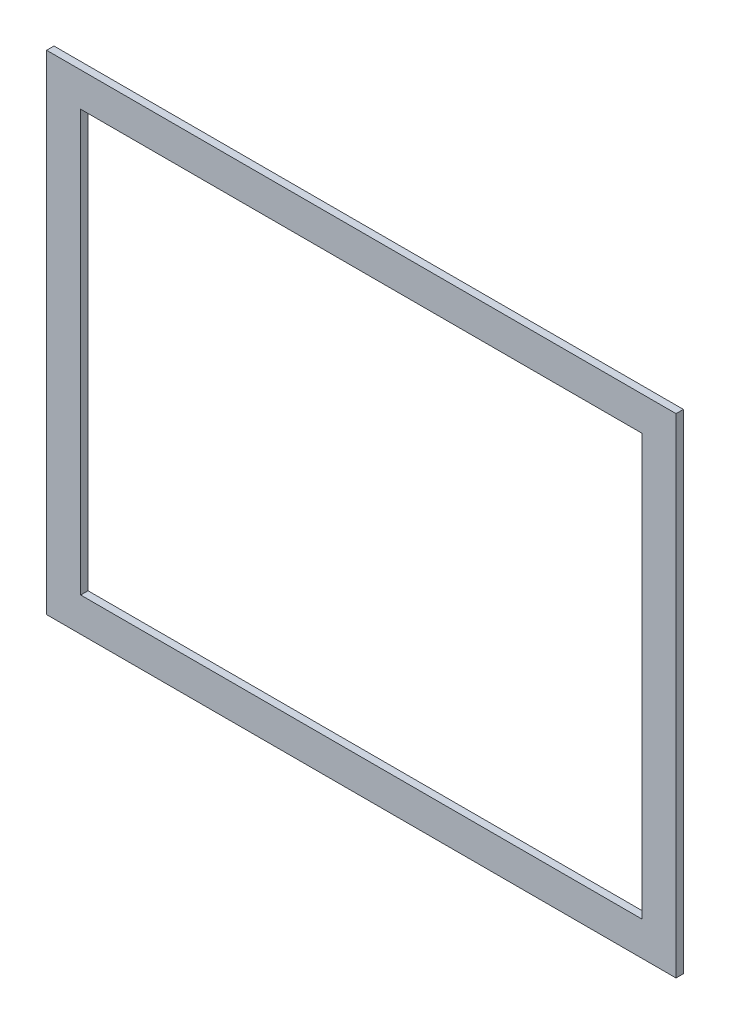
ISO-10303-21;
HEADER;
FILE_DESCRIPTION(('STEP AP214'),'2;1');
FILE_NAME('part.step','',(''),(''),'','','');
FILE_SCHEMA(('AUTOMOTIVE_DESIGN { 1 0 10303 214 1 1 1 1 }'));
ENDSEC;
DATA;
#1=APPLICATION_CONTEXT('core data for automotive mechanical design processes');
#2=APPLICATION_PROTOCOL_DEFINITION('international standard','automotive_design',2000,#1);
#3=PRODUCT_CONTEXT('',#1,'mechanical');
#4=PRODUCT('Part','Part','',(#3));
#5=PRODUCT_RELATED_PRODUCT_CATEGORY('part','',(#4));
#6=PRODUCT_DEFINITION_FORMATION('','',#4);
#7=PRODUCT_DEFINITION_CONTEXT('part definition',#1,'design');
#8=PRODUCT_DEFINITION('design','',#6,#7);
#9=PRODUCT_DEFINITION_SHAPE('','',#8);
#10=(LENGTH_UNIT() NAMED_UNIT(*) SI_UNIT(.MILLI.,.METRE.));
#11=(NAMED_UNIT(*) PLANE_ANGLE_UNIT() SI_UNIT($,.RADIAN.));
#12=(NAMED_UNIT(*) SI_UNIT($,.STERADIAN.) SOLID_ANGLE_UNIT());
#13=UNCERTAINTY_MEASURE_WITH_UNIT(LENGTH_MEASURE(1.E-05),#10,'distance_accuracy_value','');
#14=(GEOMETRIC_REPRESENTATION_CONTEXT(3) GLOBAL_UNCERTAINTY_ASSIGNED_CONTEXT((#13)) GLOBAL_UNIT_ASSIGNED_CONTEXT((#10,
#11,#12)) REPRESENTATION_CONTEXT('',''));
#15=CARTESIAN_POINT('',(0.,0.,0.));
#16=DIRECTION('',(0.,0.,1.));
#17=DIRECTION('',(1.,0.,0.));
#18=AXIS2_PLACEMENT_3D('',#15,#16,#17);
#19=CARTESIAN_POINT('',(0.,0.,0.65));
#20=DIRECTION('',(0.,0.,-1.));
#21=DIRECTION('',(-1.,0.,0.));
#22=AXIS2_PLACEMENT_3D('',#19,#20,#21);
#23=PLANE('',#22);
#24=DIRECTION('',(-1.,0.,0.));
#25=VECTOR('',#24,1.);
#26=CARTESIAN_POINT('',(-30.1999999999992,58.3899999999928,0.65));
#27=LINE('',#26,#25);
#28=CARTESIAN_POINT('',(25.3000000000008,58.3899999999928,0.65));
#29=VERTEX_POINT('',#28);
#30=CARTESIAN_POINT('',(-30.1999999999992,58.3899999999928,0.65));
#31=VERTEX_POINT('',#30);
#32=EDGE_CURVE('E140',#29,#31,#27,.T.);
#33=ORIENTED_EDGE('',*,*,#32,.T.);
#34=DIRECTION('',(0.,-1.,0.));
#35=VECTOR('',#34,1.);
#36=CARTESIAN_POINT('',(-30.1999999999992,58.3899999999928,0.65));
#37=LINE('',#36,#35);
#38=CARTESIAN_POINT('',(-30.1999999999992,15.2899999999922,0.65));
#39=VERTEX_POINT('',#38);
#40=EDGE_CURVE('E143',#31,#39,#37,.T.);
#41=ORIENTED_EDGE('',*,*,#40,.T.);
#42=DIRECTION('',(1.,0.,0.));
#43=VECTOR('',#42,1.);
#44=CARTESIAN_POINT('',(-30.1999999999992,15.2899999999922,0.65));
#45=LINE('',#44,#43);
#46=CARTESIAN_POINT('',(25.3000000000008,15.2899999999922,0.65));
#47=VERTEX_POINT('',#46);
#48=EDGE_CURVE('E146',#39,#47,#45,.T.);
#49=ORIENTED_EDGE('',*,*,#48,.T.);
#50=DIRECTION('',(0.,1.,0.));
#51=VECTOR('',#50,1.);
#52=CARTESIAN_POINT('',(25.3000000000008,58.3899999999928,0.65));
#53=LINE('',#52,#51);
#54=EDGE_CURVE('E148',#47,#29,#53,.T.);
#55=ORIENTED_EDGE('',*,*,#54,.T.);
#56=EDGE_LOOP('',(#33,#41,#49,#55));
#57=FACE_BOUND('',#56,.T.);
#58=DIRECTION('',(0.,-1.,0.));
#59=VECTOR('',#58,1.);
#60=CARTESIAN_POINT('',(-27.1999999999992,55.3899999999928,0.65));
#61=LINE('',#60,#59);
#62=CARTESIAN_POINT('',(-27.1999999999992,55.3899999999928,0.65));
#63=VERTEX_POINT('',#62);
#64=CARTESIAN_POINT('',(-27.1999999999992,18.2899999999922,0.65));
#65=VERTEX_POINT('',#64);
#66=EDGE_CURVE('E104',#63,#65,#61,.T.);
#67=ORIENTED_EDGE('',*,*,#66,.F.);
#68=DIRECTION('',(-1.,0.,0.));
#69=VECTOR('',#68,1.);
#70=CARTESIAN_POINT('',(-27.1999999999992,55.3899999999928,0.65));
#71=LINE('',#70,#69);
#72=CARTESIAN_POINT('',(22.3000000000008,55.3899999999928,0.65));
#73=VERTEX_POINT('',#72);
#74=EDGE_CURVE('E126',#73,#63,#71,.T.);
#75=ORIENTED_EDGE('',*,*,#74,.F.);
#76=DIRECTION('',(0.,1.,0.));
#77=VECTOR('',#76,1.);
#78=CARTESIAN_POINT('',(22.3000000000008,55.3899999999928,0.65));
#79=LINE('',#78,#77);
#80=CARTESIAN_POINT('',(22.3000000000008,18.2899999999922,0.65));
#81=VERTEX_POINT('',#80);
#82=EDGE_CURVE('E124',#81,#73,#79,.T.);
#83=ORIENTED_EDGE('',*,*,#82,.F.);
#84=DIRECTION('',(1.,0.,0.));
#85=VECTOR('',#84,1.);
#86=CARTESIAN_POINT('',(-27.1999999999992,18.2899999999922,0.65));
#87=LINE('',#86,#85);
#88=EDGE_CURVE('E112',#65,#81,#87,.T.);
#89=ORIENTED_EDGE('',*,*,#88,.F.);
#90=EDGE_LOOP('',(#67,#75,#83,#89));
#91=FACE_BOUND('',#90,.T.);
#92=ADVANCED_FACE('F39',(#57,#91),#23,.F.);
#93=CARTESIAN_POINT('',(0.,0.,0.));
#94=DIRECTION('',(0.,0.,-1.));
#95=DIRECTION('',(-1.,0.,0.));
#96=AXIS2_PLACEMENT_3D('',#93,#94,#95);
#97=PLANE('',#96);
#98=DIRECTION('',(-1.,0.,0.));
#99=VECTOR('',#98,1.);
#100=CARTESIAN_POINT('',(-30.1999999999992,58.3899999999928,0.));
#101=LINE('',#100,#99);
#102=CARTESIAN_POINT('',(25.3000000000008,58.3899999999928,0.));
#103=VERTEX_POINT('',#102);
#104=CARTESIAN_POINT('',(-30.1999999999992,58.3899999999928,0.));
#105=VERTEX_POINT('',#104);
#106=EDGE_CURVE('E120',#103,#105,#101,.T.);
#107=ORIENTED_EDGE('',*,*,#106,.F.);
#108=DIRECTION('',(0.,1.,0.));
#109=VECTOR('',#108,1.);
#110=CARTESIAN_POINT('',(25.3000000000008,58.3899999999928,0.));
#111=LINE('',#110,#109);
#112=CARTESIAN_POINT('',(25.3000000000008,15.2899999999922,0.));
#113=VERTEX_POINT('',#112);
#114=EDGE_CURVE('E144',#113,#103,#111,.T.);
#115=ORIENTED_EDGE('',*,*,#114,.F.);
#116=DIRECTION('',(1.,0.,0.));
#117=VECTOR('',#116,1.);
#118=CARTESIAN_POINT('',(-30.1999999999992,15.2899999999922,0.));
#119=LINE('',#118,#117);
#120=CARTESIAN_POINT('',(-30.1999999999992,15.2899999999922,0.));
#121=VERTEX_POINT('',#120);
#122=EDGE_CURVE('E155',#121,#113,#119,.T.);
#123=ORIENTED_EDGE('',*,*,#122,.F.);
#124=DIRECTION('',(0.,-1.,0.));
#125=VECTOR('',#124,1.);
#126=CARTESIAN_POINT('',(-30.1999999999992,58.3899999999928,0.));
#127=LINE('',#126,#125);
#128=EDGE_CURVE('E153',#105,#121,#127,.T.);
#129=ORIENTED_EDGE('',*,*,#128,.F.);
#130=EDGE_LOOP('',(#107,#115,#123,#129));
#131=FACE_BOUND('',#130,.T.);
#132=DIRECTION('',(-1.,0.,0.));
#133=VECTOR('',#132,1.);
#134=CARTESIAN_POINT('',(-27.1999999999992,55.3899999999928,0.));
#135=LINE('',#134,#133);
#136=CARTESIAN_POINT('',(22.3000000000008,55.3899999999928,0.));
#137=VERTEX_POINT('',#136);
#138=CARTESIAN_POINT('',(-27.1999999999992,55.3899999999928,0.));
#139=VERTEX_POINT('',#138);
#140=EDGE_CURVE('E113',#137,#139,#135,.T.);
#141=ORIENTED_EDGE('',*,*,#140,.T.);
#142=DIRECTION('',(0.,-1.,0.));
#143=VECTOR('',#142,1.);
#144=CARTESIAN_POINT('',(-27.1999999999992,55.3899999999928,0.));
#145=LINE('',#144,#143);
#146=CARTESIAN_POINT('',(-27.1999999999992,18.2899999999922,0.));
#147=VERTEX_POINT('',#146);
#148=EDGE_CURVE('E62',#139,#147,#145,.T.);
#149=ORIENTED_EDGE('',*,*,#148,.T.);
#150=DIRECTION('',(1.,0.,0.));
#151=VECTOR('',#150,1.);
#152=CARTESIAN_POINT('',(-27.1999999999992,18.2899999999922,0.));
#153=LINE('',#152,#151);
#154=CARTESIAN_POINT('',(22.3000000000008,18.2899999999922,0.));
#155=VERTEX_POINT('',#154);
#156=EDGE_CURVE('E119',#147,#155,#153,.T.);
#157=ORIENTED_EDGE('',*,*,#156,.T.);
#158=DIRECTION('',(0.,1.,0.));
#159=VECTOR('',#158,1.);
#160=CARTESIAN_POINT('',(22.3000000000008,55.3899999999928,0.));
#161=LINE('',#160,#159);
#162=EDGE_CURVE('E132',#155,#137,#161,.T.);
#163=ORIENTED_EDGE('',*,*,#162,.T.);
#164=EDGE_LOOP('',(#141,#149,#157,#163));
#165=FACE_BOUND('',#164,.T.);
#166=ADVANCED_FACE('F173',(#131,#165),#97,.T.);
#167=CARTESIAN_POINT('',(-30.1999999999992,58.3899999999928,0.65));
#168=DIRECTION('',(0.,-1.,0.));
#169=DIRECTION('',(0.,0.,-1.));
#170=AXIS2_PLACEMENT_3D('',#167,#168,#169);
#171=PLANE('',#170);
#172=ORIENTED_EDGE('',*,*,#106,.T.);
#173=DIRECTION('',(0.,0.,-1.));
#174=VECTOR('',#173,1.);
#175=CARTESIAN_POINT('',(-30.1999999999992,58.3899999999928,0.65));
#176=LINE('',#175,#174);
#177=EDGE_CURVE('E11',#31,#105,#176,.T.);
#178=ORIENTED_EDGE('',*,*,#177,.F.);
#179=ORIENTED_EDGE('',*,*,#32,.F.);
#180=DIRECTION('',(0.,0.,-1.));
#181=VECTOR('',#180,1.);
#182=CARTESIAN_POINT('',(25.3000000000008,58.3899999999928,0.65));
#183=LINE('',#182,#181);
#184=EDGE_CURVE('E150',#29,#103,#183,.T.);
#185=ORIENTED_EDGE('',*,*,#184,.T.);
#186=EDGE_LOOP('',(#172,#178,#179,#185));
#187=FACE_BOUND('',#186,.T.);
#188=ADVANCED_FACE('F41',(#187),#171,.F.);
#189=CARTESIAN_POINT('',(-30.1999999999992,58.3899999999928,0.65));
#190=DIRECTION('',(1.,0.,0.));
#191=DIRECTION('',(0.,1.,0.));
#192=AXIS2_PLACEMENT_3D('',#189,#190,#191);
#193=PLANE('',#192);
#194=ORIENTED_EDGE('',*,*,#128,.T.);
#195=DIRECTION('',(0.,0.,-1.));
#196=VECTOR('',#195,1.);
#197=CARTESIAN_POINT('',(-30.1999999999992,15.2899999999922,0.65));
#198=LINE('',#197,#196);
#199=EDGE_CURVE('E47',#39,#121,#198,.T.);
#200=ORIENTED_EDGE('',*,*,#199,.F.);
#201=ORIENTED_EDGE('',*,*,#40,.F.);
#202=ORIENTED_EDGE('',*,*,#177,.T.);
#203=EDGE_LOOP('',(#194,#200,#201,#202));
#204=FACE_BOUND('',#203,.T.);
#205=ADVANCED_FACE('F183',(#204),#193,.F.);
#206=CARTESIAN_POINT('',(-30.1999999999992,15.2899999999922,0.65));
#207=DIRECTION('',(0.,1.,0.));
#208=DIRECTION('',(-1.,0.,0.));
#209=AXIS2_PLACEMENT_3D('',#206,#207,#208);
#210=PLANE('',#209);
#211=ORIENTED_EDGE('',*,*,#122,.T.);
#212=DIRECTION('',(0.,0.,-1.));
#213=VECTOR('',#212,1.);
#214=CARTESIAN_POINT('',(25.3000000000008,15.2899999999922,0.65));
#215=LINE('',#214,#213);
#216=EDGE_CURVE('E160',#47,#113,#215,.T.);
#217=ORIENTED_EDGE('',*,*,#216,.F.);
#218=ORIENTED_EDGE('',*,*,#48,.F.);
#219=ORIENTED_EDGE('',*,*,#199,.T.);
#220=EDGE_LOOP('',(#211,#217,#218,#219));
#221=FACE_BOUND('',#220,.T.);
#222=ADVANCED_FACE('F167',(#221),#210,.F.);
#223=CARTESIAN_POINT('',(25.3000000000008,58.3899999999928,0.65));
#224=DIRECTION('',(-1.,0.,0.));
#225=DIRECTION('',(0.,-1.,0.));
#226=AXIS2_PLACEMENT_3D('',#223,#224,#225);
#227=PLANE('',#226);
#228=ORIENTED_EDGE('',*,*,#114,.T.);
#229=ORIENTED_EDGE('',*,*,#184,.F.);
#230=ORIENTED_EDGE('',*,*,#54,.F.);
#231=ORIENTED_EDGE('',*,*,#216,.T.);
#232=EDGE_LOOP('',(#228,#229,#230,#231));
#233=FACE_BOUND('',#232,.T.);
#234=ADVANCED_FACE('F177',(#233),#227,.F.);
#235=CARTESIAN_POINT('',(-27.1999999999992,55.3899999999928,0.65));
#236=DIRECTION('',(1.,0.,0.));
#237=DIRECTION('',(0.,1.,0.));
#238=AXIS2_PLACEMENT_3D('',#235,#236,#237);
#239=PLANE('',#238);
#240=ORIENTED_EDGE('',*,*,#148,.F.);
#241=DIRECTION('',(0.,0.,-1.));
#242=VECTOR('',#241,1.);
#243=CARTESIAN_POINT('',(-27.1999999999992,55.3899999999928,0.65));
#244=LINE('',#243,#242);
#245=EDGE_CURVE('E108',#63,#139,#244,.T.);
#246=ORIENTED_EDGE('',*,*,#245,.F.);
#247=ORIENTED_EDGE('',*,*,#66,.T.);
#248=DIRECTION('',(0.,0.,-1.));
#249=VECTOR('',#248,1.);
#250=CARTESIAN_POINT('',(-27.1999999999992,18.2899999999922,0.65));
#251=LINE('',#250,#249);
#252=EDGE_CURVE('E107',#65,#147,#251,.T.);
#253=ORIENTED_EDGE('',*,*,#252,.T.);
#254=EDGE_LOOP('',(#240,#246,#247,#253));
#255=FACE_BOUND('',#254,.T.);
#256=ADVANCED_FACE('F106',(#255),#239,.T.);
#257=CARTESIAN_POINT('',(-27.1999999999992,18.2899999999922,0.65));
#258=DIRECTION('',(0.,1.,0.));
#259=DIRECTION('',(0.,0.,1.));
#260=AXIS2_PLACEMENT_3D('',#257,#258,#259);
#261=PLANE('',#260);
#262=ORIENTED_EDGE('',*,*,#156,.F.);
#263=ORIENTED_EDGE('',*,*,#252,.F.);
#264=ORIENTED_EDGE('',*,*,#88,.T.);
#265=DIRECTION('',(0.,0.,-1.));
#266=VECTOR('',#265,1.);
#267=CARTESIAN_POINT('',(22.3000000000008,18.2899999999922,0.65));
#268=LINE('',#267,#266);
#269=EDGE_CURVE('E121',#81,#155,#268,.T.);
#270=ORIENTED_EDGE('',*,*,#269,.T.);
#271=EDGE_LOOP('',(#262,#263,#264,#270));
#272=FACE_BOUND('',#271,.T.);
#273=ADVANCED_FACE('F116',(#272),#261,.T.);
#274=CARTESIAN_POINT('',(22.3000000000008,55.3899999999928,0.65));
#275=DIRECTION('',(-1.,0.,0.));
#276=DIRECTION('',(0.,-1.,0.));
#277=AXIS2_PLACEMENT_3D('',#274,#275,#276);
#278=PLANE('',#277);
#279=ORIENTED_EDGE('',*,*,#162,.F.);
#280=ORIENTED_EDGE('',*,*,#269,.F.);
#281=ORIENTED_EDGE('',*,*,#82,.T.);
#282=DIRECTION('',(0.,0.,-1.));
#283=VECTOR('',#282,1.);
#284=CARTESIAN_POINT('',(22.3000000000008,55.3899999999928,0.65));
#285=LINE('',#284,#283);
#286=EDGE_CURVE('E54',#73,#137,#285,.T.);
#287=ORIENTED_EDGE('',*,*,#286,.T.);
#288=EDGE_LOOP('',(#279,#280,#281,#287));
#289=FACE_BOUND('',#288,.T.);
#290=ADVANCED_FACE('F206',(#289),#278,.T.);
#291=CARTESIAN_POINT('',(-27.1999999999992,55.3899999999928,0.65));
#292=DIRECTION('',(0.,-1.,0.));
#293=DIRECTION('',(0.,0.,-1.));
#294=AXIS2_PLACEMENT_3D('',#291,#292,#293);
#295=PLANE('',#294);
#296=ORIENTED_EDGE('',*,*,#140,.F.);
#297=ORIENTED_EDGE('',*,*,#286,.F.);
#298=ORIENTED_EDGE('',*,*,#74,.T.);
#299=ORIENTED_EDGE('',*,*,#245,.T.);
#300=EDGE_LOOP('',(#296,#297,#298,#299));
#301=FACE_BOUND('',#300,.T.);
#302=ADVANCED_FACE('F210',(#301),#295,.T.);
#303=CLOSED_SHELL('',(#92,#166,#188,#205,#222,#234,#256,#273,#290,#302));
#304=MANIFOLD_SOLID_BREP('B2',#303);
#305=ADVANCED_BREP_SHAPE_REPRESENTATION('',(#18,#304),#14);
#306=SHAPE_DEFINITION_REPRESENTATION(#9,#305);
ENDSEC;
END-ISO-10303-21;
